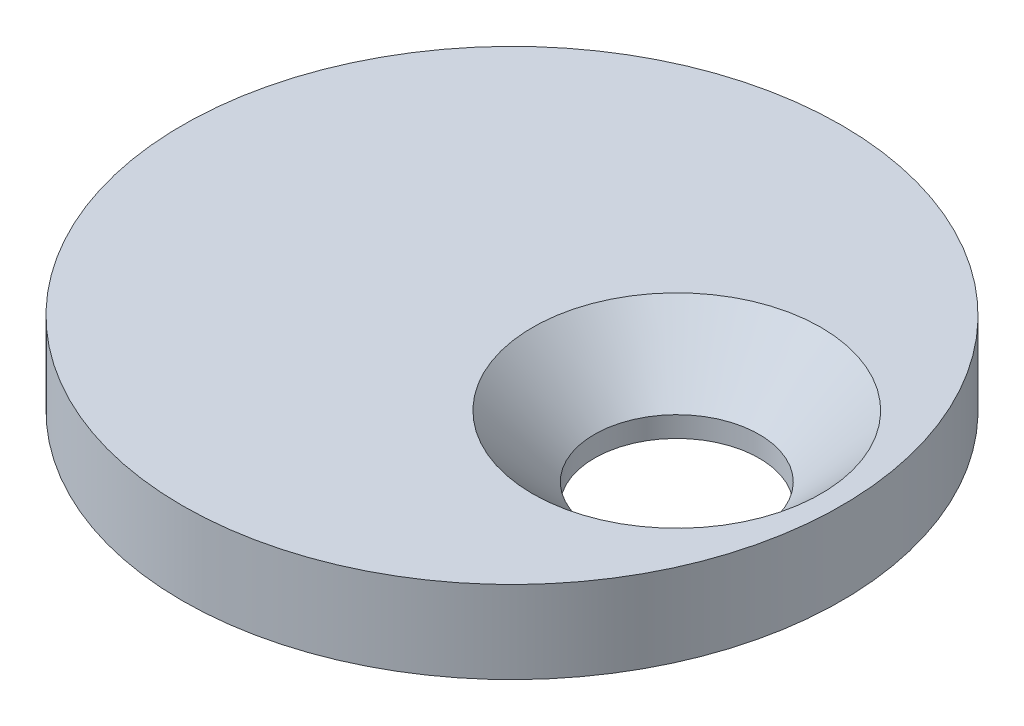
from build123d import *

# Parameters (mm, degrees)
SKETCH1_R      = 12
EXTRUDE1_DEPTH = 3


with BuildPart() as part:
    # Sketch1 → Extrude1 (new body)
    with BuildSketch(Plane(origin=(0, 0, 0), x_dir=(1, 0, 0), z_dir=(0, 1, 0))):
        with Locations(Location((0, 0, 0), (0, 0, 270))):
            Circle(SKETCH1_R)
    extrude(amount=EXTRUDE1_DEPTH)

    # Sketch3 → CSK for M6 Countersunk Flat Head Screw1 (revolve, cut)
    with BuildSketch(Plane(origin=(6, 3, 0), x_dir=(0, 0, 1), z_dir=(1, 0, 0))):
        Polygon((0, 0), (0, 3), (3, 3), (3, 2.25), (5.25, 0), align=None)
    revolve(axis=Axis((6, 9.35, 0), (0, -1, 0)), mode=Mode.SUBTRACT)


solid = part.part
